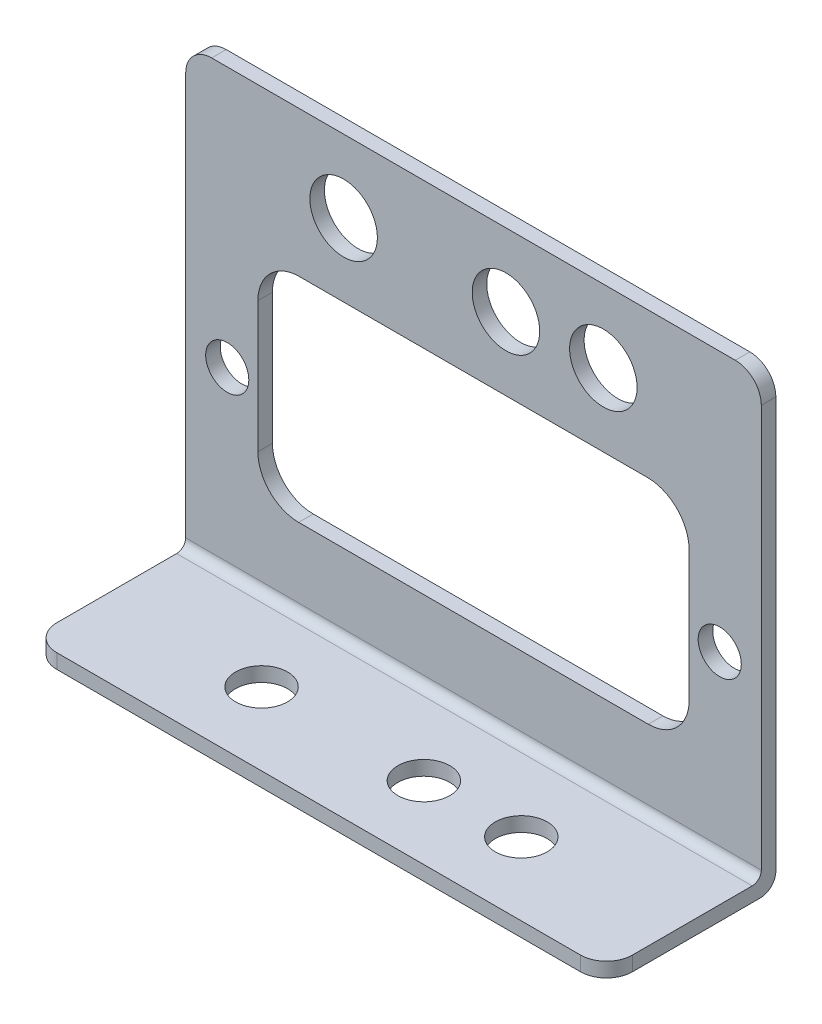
ISO-10303-21;
HEADER;
FILE_DESCRIPTION(('STEP AP214'),'2;1');
FILE_NAME('part.step','',(''),(''),'','','');
FILE_SCHEMA(('AUTOMOTIVE_DESIGN { 1 0 10303 214 1 1 1 1 }'));
ENDSEC;
DATA;
#1=APPLICATION_CONTEXT('core data for automotive mechanical design processes');
#2=APPLICATION_PROTOCOL_DEFINITION('international standard','automotive_design',2000,#1);
#3=PRODUCT_CONTEXT('',#1,'mechanical');
#4=PRODUCT('Part','Part','',(#3));
#5=PRODUCT_RELATED_PRODUCT_CATEGORY('part','',(#4));
#6=PRODUCT_DEFINITION_FORMATION('','',#4);
#7=PRODUCT_DEFINITION_CONTEXT('part definition',#1,'design');
#8=PRODUCT_DEFINITION('design','',#6,#7);
#9=PRODUCT_DEFINITION_SHAPE('','',#8);
#10=(LENGTH_UNIT() NAMED_UNIT(*) SI_UNIT(.MILLI.,.METRE.));
#11=(NAMED_UNIT(*) PLANE_ANGLE_UNIT() SI_UNIT($,.RADIAN.));
#12=(NAMED_UNIT(*) SI_UNIT($,.STERADIAN.) SOLID_ANGLE_UNIT());
#13=UNCERTAINTY_MEASURE_WITH_UNIT(LENGTH_MEASURE(1.E-05),#10,'distance_accuracy_value','');
#14=(GEOMETRIC_REPRESENTATION_CONTEXT(3) GLOBAL_UNCERTAINTY_ASSIGNED_CONTEXT((#13)) GLOBAL_UNIT_ASSIGNED_CONTEXT((#10,
#11,#12)) REPRESENTATION_CONTEXT('',''));
#15=CARTESIAN_POINT('',(0.,0.,0.));
#16=DIRECTION('',(0.,0.,1.));
#17=DIRECTION('',(1.,0.,0.));
#18=AXIS2_PLACEMENT_3D('',#15,#16,#17);
#19=CARTESIAN_POINT('',(56.2864,0.,16.5608));
#20=DIRECTION('',(0.,0.,-1.));
#21=DIRECTION('',(-1.,0.,0.));
#22=AXIS2_PLACEMENT_3D('',#19,#20,#21);
#23=PLANE('',#22);
#24=DIRECTION('',(-1.,0.,0.));
#25=VECTOR('',#24,1.);
#26=CARTESIAN_POINT('',(56.2864,0.,16.5608));
#27=LINE('',#26,#25);
#28=CARTESIAN_POINT('',(53.7464,0.,16.5608));
#29=VERTEX_POINT('',#28);
#30=CARTESIAN_POINT('',(2.54,0.,16.5608));
#31=VERTEX_POINT('',#30);
#32=EDGE_CURVE('E313',#29,#31,#27,.T.);
#33=ORIENTED_EDGE('',*,*,#32,.F.);
#34=DIRECTION('',(0.,-1.,0.));
#35=VECTOR('',#34,1.);
#36=CARTESIAN_POINT('',(53.7464,1.4224,16.5608));
#37=LINE('',#36,#35);
#38=CARTESIAN_POINT('',(53.7464,1.4224,16.5608));
#39=VERTEX_POINT('',#38);
#40=EDGE_CURVE('E326',#29,#39,#37,.F.);
#41=ORIENTED_EDGE('',*,*,#40,.T.);
#42=DIRECTION('',(-1.,0.,0.));
#43=VECTOR('',#42,1.);
#44=CARTESIAN_POINT('',(56.2864,1.4224,16.5608));
#45=LINE('',#44,#43);
#46=CARTESIAN_POINT('',(2.54,1.4224,16.5608));
#47=VERTEX_POINT('',#46);
#48=EDGE_CURVE('E282',#39,#47,#45,.T.);
#49=ORIENTED_EDGE('',*,*,#48,.T.);
#50=DIRECTION('',(0.,-1.,0.));
#51=VECTOR('',#50,1.);
#52=CARTESIAN_POINT('',(2.54,0.,16.5608));
#53=LINE('',#52,#51);
#54=EDGE_CURVE('E323',#47,#31,#53,.T.);
#55=ORIENTED_EDGE('',*,*,#54,.T.);
#56=EDGE_LOOP('',(#33,#41,#49,#55));
#57=FACE_BOUND('',#56,.T.);
#58=ADVANCED_FACE('F32',(#57),#23,.F.);
#59=CARTESIAN_POINT('',(56.2864,0.,1.52400000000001));
#60=DIRECTION('',(0.,1.,0.));
#61=DIRECTION('',(0.,0.,1.));
#62=AXIS2_PLACEMENT_3D('',#59,#60,#61);
#63=PLANE('',#62);
#64=CARTESIAN_POINT('',(31.3182,0.,9.4488));
#65=DIRECTION('',(0.,1.,0.));
#66=DIRECTION('',(0.,0.,1.));
#67=AXIS2_PLACEMENT_3D('',#64,#65,#66);
#68=CIRCLE('',#67,2.54);
#69=CARTESIAN_POINT('',(31.3182,0.,11.9888));
#70=VERTEX_POINT('',#69);
#71=EDGE_CURVE('E249',#70,#70,#68,.T.);
#72=ORIENTED_EDGE('',*,*,#71,.T.);
#73=EDGE_LOOP('',(#72));
#74=FACE_BOUND('',#73,.T.);
#75=CARTESIAN_POINT('',(40.8432,0.,9.4488));
#76=DIRECTION('',(0.,1.,0.));
#77=DIRECTION('',(0.,0.,1.));
#78=AXIS2_PLACEMENT_3D('',#75,#76,#77);
#79=CIRCLE('',#78,2.54);
#80=CARTESIAN_POINT('',(40.8432,0.,11.9888));
#81=VERTEX_POINT('',#80);
#82=EDGE_CURVE('E255',#81,#81,#79,.T.);
#83=ORIENTED_EDGE('',*,*,#82,.T.);
#84=EDGE_LOOP('',(#83));
#85=FACE_BOUND('',#84,.T.);
#86=CARTESIAN_POINT('',(15.4432,0.,9.44880000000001));
#87=DIRECTION('',(0.,1.,0.));
#88=DIRECTION('',(0.,0.,1.));
#89=AXIS2_PLACEMENT_3D('',#86,#87,#88);
#90=CIRCLE('',#89,2.54);
#91=CARTESIAN_POINT('',(15.4432,0.,11.9888));
#92=VERTEX_POINT('',#91);
#93=EDGE_CURVE('E261',#92,#92,#90,.T.);
#94=ORIENTED_EDGE('',*,*,#93,.T.);
#95=EDGE_LOOP('',(#94));
#96=FACE_BOUND('',#95,.T.);
#97=DIRECTION('',(0.,0.,-1.));
#98=VECTOR('',#97,1.);
#99=CARTESIAN_POINT('',(56.2864,0.,1.52400000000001));
#100=LINE('',#99,#98);
#101=CARTESIAN_POINT('',(56.2864,0.,14.0208));
#102=VERTEX_POINT('',#101);
#103=CARTESIAN_POINT('',(56.2864,0.,1.52400000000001));
#104=VERTEX_POINT('',#103);
#105=EDGE_CURVE('E267',#102,#104,#100,.T.);
#106=ORIENTED_EDGE('',*,*,#105,.F.);
#107=CARTESIAN_POINT('',(53.7464,0.,14.0208));
#108=DIRECTION('',(0.,1.,0.));
#109=DIRECTION('',(0.,0.,1.));
#110=AXIS2_PLACEMENT_3D('',#107,#108,#109);
#111=CIRCLE('',#110,2.54);
#112=EDGE_CURVE('E321',#102,#29,#111,.F.);
#113=ORIENTED_EDGE('',*,*,#112,.T.);
#114=ORIENTED_EDGE('',*,*,#32,.T.);
#115=CARTESIAN_POINT('',(2.54,0.,14.0208));
#116=DIRECTION('',(0.,1.,0.));
#117=DIRECTION('',(0.,0.,1.));
#118=AXIS2_PLACEMENT_3D('',#115,#116,#117);
#119=CIRCLE('',#118,2.54);
#120=CARTESIAN_POINT('',(0.,0.,14.0208));
#121=VERTEX_POINT('',#120);
#122=EDGE_CURVE('E319',#31,#121,#119,.F.);
#123=ORIENTED_EDGE('',*,*,#122,.T.);
#124=DIRECTION('',(0.,0.,-1.));
#125=VECTOR('',#124,1.);
#126=CARTESIAN_POINT('',(0.,0.,1.52400000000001));
#127=LINE('',#126,#125);
#128=CARTESIAN_POINT('',(0.,0.,1.52400000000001));
#129=VERTEX_POINT('',#128);
#130=EDGE_CURVE('E264',#121,#129,#127,.T.);
#131=ORIENTED_EDGE('',*,*,#130,.T.);
#132=DIRECTION('',(-1.,0.,0.));
#133=VECTOR('',#132,1.);
#134=CARTESIAN_POINT('',(56.2864,0.,1.52400000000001));
#135=LINE('',#134,#133);
#136=EDGE_CURVE('E310',#104,#129,#135,.T.);
#137=ORIENTED_EDGE('',*,*,#136,.F.);
#138=EDGE_LOOP('',(#106,#113,#114,#123,#131,#137));
#139=FACE_BOUND('',#138,.T.);
#140=ADVANCED_FACE('F385',(#74,#85,#96,#139),#63,.F.);
#141=CARTESIAN_POINT('',(56.2864,1.524,1.524));
#142=DIRECTION('',(-1.,0.,0.));
#143=DIRECTION('',(0.,0.,1.));
#144=AXIS2_PLACEMENT_3D('',#141,#142,#143);
#145=CYLINDRICAL_SURFACE('',#144,1.524);
#146=CARTESIAN_POINT('',(0.,1.524,1.524));
#147=DIRECTION('',(1.,0.,0.));
#148=DIRECTION('',(0.,0.,1.));
#149=AXIS2_PLACEMENT_3D('',#146,#147,#148);
#150=CIRCLE('',#149,1.524);
#151=CARTESIAN_POINT('',(0.,1.52400000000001,0.));
#152=VERTEX_POINT('',#151);
#153=EDGE_CURVE('E284',#129,#152,#150,.T.);
#154=ORIENTED_EDGE('',*,*,#153,.T.);
#155=DIRECTION('',(-1.,0.,0.));
#156=VECTOR('',#155,1.);
#157=CARTESIAN_POINT('',(56.2864,1.52400000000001,0.));
#158=LINE('',#157,#156);
#159=CARTESIAN_POINT('',(56.2864,1.52400000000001,0.));
#160=VERTEX_POINT('',#159);
#161=EDGE_CURVE('E307',#160,#152,#158,.T.);
#162=ORIENTED_EDGE('',*,*,#161,.F.);
#163=CARTESIAN_POINT('',(56.2864,1.524,1.524));
#164=DIRECTION('',(1.,0.,0.));
#165=DIRECTION('',(0.,0.,1.));
#166=AXIS2_PLACEMENT_3D('',#163,#164,#165);
#167=CIRCLE('',#166,1.524);
#168=EDGE_CURVE('E269',#104,#160,#167,.T.);
#169=ORIENTED_EDGE('',*,*,#168,.F.);
#170=ORIENTED_EDGE('',*,*,#136,.T.);
#171=EDGE_LOOP('',(#154,#162,#169,#170));
#172=FACE_BOUND('',#171,.T.);
#173=ADVANCED_FACE('F395',(#172),#145,.T.);
#174=CARTESIAN_POINT('',(56.2864,1.52400000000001,0.));
#175=DIRECTION('',(0.,0.,1.));
#176=DIRECTION('',(1.,0.,0.));
#177=AXIS2_PLACEMENT_3D('',#174,#175,#176);
#178=PLANE('',#177);
#179=CARTESIAN_POINT('',(40.8432,37.1094,0.));
#180=DIRECTION('',(0.,0.,1.));
#181=DIRECTION('',(1.,0.,0.));
#182=AXIS2_PLACEMENT_3D('',#179,#180,#181);
#183=CIRCLE('',#182,3.302);
#184=CARTESIAN_POINT('',(44.1452,37.1094,0.));
#185=VERTEX_POINT('',#184);
#186=EDGE_CURVE('E712',#185,#185,#183,.T.);
#187=ORIENTED_EDGE('',*,*,#186,.T.);
#188=EDGE_LOOP('',(#187));
#189=FACE_BOUND('',#188,.T.);
#190=CARTESIAN_POINT('',(15.4432,37.1094,0.));
#191=DIRECTION('',(0.,0.,1.));
#192=DIRECTION('',(1.,0.,0.));
#193=AXIS2_PLACEMENT_3D('',#190,#191,#192);
#194=CIRCLE('',#193,3.302);
#195=CARTESIAN_POINT('',(18.7452,37.1094,0.));
#196=VERTEX_POINT('',#195);
#197=EDGE_CURVE('E715',#196,#196,#194,.T.);
#198=ORIENTED_EDGE('',*,*,#197,.T.);
#199=EDGE_LOOP('',(#198));
#200=FACE_BOUND('',#199,.T.);
#201=CARTESIAN_POINT('',(31.3182,37.1094,0.));
#202=DIRECTION('',(0.,0.,1.));
#203=DIRECTION('',(1.,0.,0.));
#204=AXIS2_PLACEMENT_3D('',#201,#202,#203);
#205=CIRCLE('',#204,3.302);
#206=CARTESIAN_POINT('',(34.6202,37.1094,0.));
#207=VERTEX_POINT('',#206);
#208=EDGE_CURVE('E706',#207,#207,#205,.T.);
#209=ORIENTED_EDGE('',*,*,#208,.T.);
#210=EDGE_LOOP('',(#209));
#211=FACE_BOUND('',#210,.T.);
#212=CARTESIAN_POINT('',(52.2224,18.7706,0.));
#213=DIRECTION('',(0.,0.,1.));
#214=DIRECTION('',(1.,0.,0.));
#215=AXIS2_PLACEMENT_3D('',#212,#213,#214);
#216=CIRCLE('',#215,2.1082);
#217=CARTESIAN_POINT('',(54.3306,18.7706,0.));
#218=VERTEX_POINT('',#217);
#219=EDGE_CURVE('E700',#218,#218,#216,.T.);
#220=ORIENTED_EDGE('',*,*,#219,.T.);
#221=EDGE_LOOP('',(#220));
#222=FACE_BOUND('',#221,.T.);
#223=CARTESIAN_POINT('',(4.064,18.7706,0.));
#224=DIRECTION('',(0.,0.,1.));
#225=DIRECTION('',(1.,0.,0.));
#226=AXIS2_PLACEMENT_3D('',#223,#224,#225);
#227=CIRCLE('',#226,2.1082);
#228=CARTESIAN_POINT('',(6.1722,18.7706,0.));
#229=VERTEX_POINT('',#228);
#230=EDGE_CURVE('E219',#229,#229,#227,.T.);
#231=ORIENTED_EDGE('',*,*,#230,.T.);
#232=EDGE_LOOP('',(#231));
#233=FACE_BOUND('',#232,.T.);
#234=DIRECTION('',(1.,0.,0.));
#235=VECTOR('',#234,1.);
#236=CARTESIAN_POINT('',(28.1432,9.144,0.));
#237=LINE('',#236,#235);
#238=CARTESIAN_POINT('',(11.049,9.144,0.));
#239=VERTEX_POINT('',#238);
#240=CARTESIAN_POINT('',(45.2374,9.144,0.));
#241=VERTEX_POINT('',#240);
#242=EDGE_CURVE('E182',#239,#241,#237,.T.);
#243=ORIENTED_EDGE('',*,*,#242,.T.);
#244=CARTESIAN_POINT('',(45.2374,13.1318,0.));
#245=DIRECTION('',(0.,0.,1.));
#246=DIRECTION('',(-1.,0.,0.));
#247=AXIS2_PLACEMENT_3D('',#244,#245,#246);
#248=CIRCLE('',#247,3.9878);
#249=CARTESIAN_POINT('',(49.2252,13.1318,0.));
#250=VERTEX_POINT('',#249);
#251=EDGE_CURVE('E174',#241,#250,#248,.T.);
#252=ORIENTED_EDGE('',*,*,#251,.T.);
#253=DIRECTION('',(0.,1.,0.));
#254=VECTOR('',#253,1.);
#255=CARTESIAN_POINT('',(49.2252,25.9334,0.));
#256=LINE('',#255,#254);
#257=CARTESIAN_POINT('',(49.2252,25.9334,0.));
#258=VERTEX_POINT('',#257);
#259=EDGE_CURVE('E186',#250,#258,#256,.T.);
#260=ORIENTED_EDGE('',*,*,#259,.T.);
#261=CARTESIAN_POINT('',(45.1612,25.9334,0.));
#262=DIRECTION('',(0.,0.,1.));
#263=DIRECTION('',(-1.,0.,0.));
#264=AXIS2_PLACEMENT_3D('',#261,#262,#263);
#265=CIRCLE('',#264,4.064);
#266=CARTESIAN_POINT('',(45.1612,29.9974,0.));
#267=VERTEX_POINT('',#266);
#268=EDGE_CURVE('E190',#258,#267,#265,.T.);
#269=ORIENTED_EDGE('',*,*,#268,.T.);
#270=DIRECTION('',(-1.,0.,0.));
#271=VECTOR('',#270,1.);
#272=CARTESIAN_POINT('',(11.1252,29.9974,0.));
#273=LINE('',#272,#271);
#274=CARTESIAN_POINT('',(11.1252,29.9974,0.));
#275=VERTEX_POINT('',#274);
#276=EDGE_CURVE('E205',#267,#275,#273,.T.);
#277=ORIENTED_EDGE('',*,*,#276,.T.);
#278=CARTESIAN_POINT('',(11.1252,25.9334,0.));
#279=DIRECTION('',(0.,0.,1.));
#280=DIRECTION('',(1.,0.,0.));
#281=AXIS2_PLACEMENT_3D('',#278,#279,#280);
#282=CIRCLE('',#281,4.064);
#283=CARTESIAN_POINT('',(7.0612,25.9334,0.));
#284=VERTEX_POINT('',#283);
#285=EDGE_CURVE('E208',#275,#284,#282,.T.);
#286=ORIENTED_EDGE('',*,*,#285,.T.);
#287=DIRECTION('',(0.,-1.,0.));
#288=VECTOR('',#287,1.);
#289=CARTESIAN_POINT('',(7.0612,13.1318,0.));
#290=LINE('',#289,#288);
#291=CARTESIAN_POINT('',(7.0612,13.1318,0.));
#292=VERTEX_POINT('',#291);
#293=EDGE_CURVE('E211',#284,#292,#290,.T.);
#294=ORIENTED_EDGE('',*,*,#293,.T.);
#295=CARTESIAN_POINT('',(11.049,13.1318,0.));
#296=DIRECTION('',(0.,0.,1.));
#297=DIRECTION('',(-1.,0.,0.));
#298=AXIS2_PLACEMENT_3D('',#295,#296,#297);
#299=CIRCLE('',#298,3.9878);
#300=EDGE_CURVE('E214',#292,#239,#299,.T.);
#301=ORIENTED_EDGE('',*,*,#300,.T.);
#302=EDGE_LOOP('',(#243,#252,#260,#269,#277,#286,#294,#301));
#303=FACE_BOUND('',#302,.T.);
#304=DIRECTION('',(-1.,0.,0.));
#305=VECTOR('',#304,1.);
#306=CARTESIAN_POINT('',(56.2864,44.2214,0.));
#307=LINE('',#306,#305);
#308=CARTESIAN_POINT('',(53.7464,44.2214,0.));
#309=VERTEX_POINT('',#308);
#310=CARTESIAN_POINT('',(2.54,44.2214,0.));
#311=VERTEX_POINT('',#310);
#312=EDGE_CURVE('E305',#309,#311,#307,.T.);
#313=ORIENTED_EDGE('',*,*,#312,.F.);
#314=CARTESIAN_POINT('',(53.7464,41.6814,0.));
#315=DIRECTION('',(0.,0.,1.));
#316=DIRECTION('',(1.,0.,0.));
#317=AXIS2_PLACEMENT_3D('',#314,#315,#316);
#318=CIRCLE('',#317,2.54);
#319=CARTESIAN_POINT('',(56.2864,41.6814,0.));
#320=VERTEX_POINT('',#319);
#321=EDGE_CURVE('E40',#309,#320,#318,.F.);
#322=ORIENTED_EDGE('',*,*,#321,.T.);
#323=DIRECTION('',(0.,1.,0.));
#324=VECTOR('',#323,1.);
#325=CARTESIAN_POINT('',(56.2864,1.52400000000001,0.));
#326=LINE('',#325,#324);
#327=EDGE_CURVE('E272',#160,#320,#326,.T.);
#328=ORIENTED_EDGE('',*,*,#327,.F.);
#329=ORIENTED_EDGE('',*,*,#161,.T.);
#330=DIRECTION('',(0.,1.,0.));
#331=VECTOR('',#330,1.);
#332=CARTESIAN_POINT('',(0.,1.52400000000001,0.));
#333=LINE('',#332,#331);
#334=CARTESIAN_POINT('',(0.,41.6814,0.));
#335=VERTEX_POINT('',#334);
#336=EDGE_CURVE('E286',#152,#335,#333,.T.);
#337=ORIENTED_EDGE('',*,*,#336,.T.);
#338=CARTESIAN_POINT('',(2.54,41.6814,0.));
#339=DIRECTION('',(0.,0.,1.));
#340=DIRECTION('',(1.,0.,0.));
#341=AXIS2_PLACEMENT_3D('',#338,#339,#340);
#342=CIRCLE('',#341,2.54);
#343=EDGE_CURVE('E52',#335,#311,#342,.F.);
#344=ORIENTED_EDGE('',*,*,#343,.T.);
#345=EDGE_LOOP('',(#313,#322,#328,#329,#337,#344));
#346=FACE_BOUND('',#345,.T.);
#347=ADVANCED_FACE('F192',(#189,#200,#211,#222,#233,#303,#346),#178,.F.);
#348=CARTESIAN_POINT('',(56.2864,44.2214,0.));
#349=DIRECTION('',(0.,-1.,0.));
#350=DIRECTION('',(0.,0.,-1.));
#351=AXIS2_PLACEMENT_3D('',#348,#349,#350);
#352=PLANE('',#351);
#353=DIRECTION('',(-1.,0.,0.));
#354=VECTOR('',#353,1.);
#355=CARTESIAN_POINT('',(56.2864,44.2214,1.42240000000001));
#356=LINE('',#355,#354);
#357=CARTESIAN_POINT('',(53.7464,44.2214,1.42240000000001));
#358=VERTEX_POINT('',#357);
#359=CARTESIAN_POINT('',(2.54,44.2214,1.42240000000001));
#360=VERTEX_POINT('',#359);
#361=EDGE_CURVE('E302',#358,#360,#356,.T.);
#362=ORIENTED_EDGE('',*,*,#361,.F.);
#363=DIRECTION('',(0.,0.,1.));
#364=VECTOR('',#363,1.);
#365=CARTESIAN_POINT('',(53.7464,44.2214,0.));
#366=LINE('',#365,#364);
#367=EDGE_CURVE('E344',#358,#309,#366,.F.);
#368=ORIENTED_EDGE('',*,*,#367,.T.);
#369=ORIENTED_EDGE('',*,*,#312,.T.);
#370=DIRECTION('',(0.,0.,1.));
#371=VECTOR('',#370,1.);
#372=CARTESIAN_POINT('',(2.54,44.2214,0.));
#373=LINE('',#372,#371);
#374=EDGE_CURVE('E341',#311,#360,#373,.T.);
#375=ORIENTED_EDGE('',*,*,#374,.T.);
#376=EDGE_LOOP('',(#362,#368,#369,#375));
#377=FACE_BOUND('',#376,.T.);
#378=ADVANCED_FACE('F362',(#377),#352,.F.);
#379=CARTESIAN_POINT('',(56.2864,44.2214,1.42240000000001));
#380=DIRECTION('',(0.,0.,-1.));
#381=DIRECTION('',(0.,1.,0.));
#382=AXIS2_PLACEMENT_3D('',#379,#380,#381);
#383=PLANE('',#382);
#384=CARTESIAN_POINT('',(40.8432,37.1094,1.4224));
#385=DIRECTION('',(0.,0.,1.));
#386=DIRECTION('',(1.,0.,0.));
#387=AXIS2_PLACEMENT_3D('',#384,#385,#386);
#388=CIRCLE('',#387,3.302);
#389=CARTESIAN_POINT('',(44.1452,37.1094,1.4224));
#390=VERTEX_POINT('',#389);
#391=EDGE_CURVE('E673',#390,#390,#388,.T.);
#392=ORIENTED_EDGE('',*,*,#391,.F.);
#393=EDGE_LOOP('',(#392));
#394=FACE_BOUND('',#393,.T.);
#395=CARTESIAN_POINT('',(15.4432,37.1094,1.4224));
#396=DIRECTION('',(0.,0.,1.));
#397=DIRECTION('',(1.,0.,0.));
#398=AXIS2_PLACEMENT_3D('',#395,#396,#397);
#399=CIRCLE('',#398,3.302);
#400=CARTESIAN_POINT('',(18.7452,37.1094,1.4224));
#401=VERTEX_POINT('',#400);
#402=EDGE_CURVE('E677',#401,#401,#399,.T.);
#403=ORIENTED_EDGE('',*,*,#402,.F.);
#404=EDGE_LOOP('',(#403));
#405=FACE_BOUND('',#404,.T.);
#406=CARTESIAN_POINT('',(31.3182,37.1094,1.4224));
#407=DIRECTION('',(0.,0.,1.));
#408=DIRECTION('',(1.,0.,0.));
#409=AXIS2_PLACEMENT_3D('',#406,#407,#408);
#410=CIRCLE('',#409,3.302);
#411=CARTESIAN_POINT('',(34.6202,37.1094,1.4224));
#412=VERTEX_POINT('',#411);
#413=EDGE_CURVE('E681',#412,#412,#410,.T.);
#414=ORIENTED_EDGE('',*,*,#413,.F.);
#415=EDGE_LOOP('',(#414));
#416=FACE_BOUND('',#415,.T.);
#417=CARTESIAN_POINT('',(52.2224,18.7706,1.4224));
#418=DIRECTION('',(0.,0.,1.));
#419=DIRECTION('',(1.,0.,0.));
#420=AXIS2_PLACEMENT_3D('',#417,#418,#419);
#421=CIRCLE('',#420,2.1082);
#422=CARTESIAN_POINT('',(54.3306,18.7706,1.4224));
#423=VERTEX_POINT('',#422);
#424=EDGE_CURVE('E685',#423,#423,#421,.T.);
#425=ORIENTED_EDGE('',*,*,#424,.F.);
#426=EDGE_LOOP('',(#425));
#427=FACE_BOUND('',#426,.T.);
#428=CARTESIAN_POINT('',(4.064,18.7706,1.4224));
#429=DIRECTION('',(0.,0.,1.));
#430=DIRECTION('',(1.,0.,0.));
#431=AXIS2_PLACEMENT_3D('',#428,#429,#430);
#432=CIRCLE('',#431,2.1082);
#433=CARTESIAN_POINT('',(6.1722,18.7706,1.4224));
#434=VERTEX_POINT('',#433);
#435=EDGE_CURVE('E201',#434,#434,#432,.T.);
#436=ORIENTED_EDGE('',*,*,#435,.F.);
#437=EDGE_LOOP('',(#436));
#438=FACE_BOUND('',#437,.T.);
#439=DIRECTION('',(0.,1.,0.));
#440=VECTOR('',#439,1.);
#441=CARTESIAN_POINT('',(49.2252,25.9334,1.4224));
#442=LINE('',#441,#440);
#443=CARTESIAN_POINT('',(49.2252,13.1318,1.4224));
#444=VERTEX_POINT('',#443);
#445=CARTESIAN_POINT('',(49.2252,25.9334,1.4224));
#446=VERTEX_POINT('',#445);
#447=EDGE_CURVE('E218',#444,#446,#442,.T.);
#448=ORIENTED_EDGE('',*,*,#447,.F.);
#449=CARTESIAN_POINT('',(45.2374,13.1318,1.4224));
#450=DIRECTION('',(0.,0.,1.));
#451=DIRECTION('',(-1.,0.,0.));
#452=AXIS2_PLACEMENT_3D('',#449,#450,#451);
#453=CIRCLE('',#452,3.9878);
#454=CARTESIAN_POINT('',(45.2374,9.144,1.4224));
#455=VERTEX_POINT('',#454);
#456=EDGE_CURVE('E177',#455,#444,#453,.T.);
#457=ORIENTED_EDGE('',*,*,#456,.F.);
#458=DIRECTION('',(1.,0.,0.));
#459=VECTOR('',#458,1.);
#460=CARTESIAN_POINT('',(45.2374,9.144,1.4224));
#461=LINE('',#460,#459);
#462=CARTESIAN_POINT('',(11.049,9.144,1.4224));
#463=VERTEX_POINT('',#462);
#464=EDGE_CURVE('E195',#463,#455,#461,.T.);
#465=ORIENTED_EDGE('',*,*,#464,.F.);
#466=CARTESIAN_POINT('',(11.049,13.1318,1.4224));
#467=DIRECTION('',(0.,0.,1.));
#468=DIRECTION('',(-1.,0.,0.));
#469=AXIS2_PLACEMENT_3D('',#466,#467,#468);
#470=CIRCLE('',#469,3.9878);
#471=CARTESIAN_POINT('',(7.0612,13.1318,1.4224));
#472=VERTEX_POINT('',#471);
#473=EDGE_CURVE('E198',#472,#463,#470,.T.);
#474=ORIENTED_EDGE('',*,*,#473,.F.);
#475=DIRECTION('',(0.,-1.,0.));
#476=VECTOR('',#475,1.);
#477=CARTESIAN_POINT('',(7.0612,13.1318,1.4224));
#478=LINE('',#477,#476);
#479=CARTESIAN_POINT('',(7.0612,25.9334,1.4224));
#480=VERTEX_POINT('',#479);
#481=EDGE_CURVE('E230',#480,#472,#478,.T.);
#482=ORIENTED_EDGE('',*,*,#481,.F.);
#483=CARTESIAN_POINT('',(11.1252,25.9334,1.4224));
#484=DIRECTION('',(0.,0.,1.));
#485=DIRECTION('',(1.,0.,0.));
#486=AXIS2_PLACEMENT_3D('',#483,#484,#485);
#487=CIRCLE('',#486,4.064);
#488=CARTESIAN_POINT('',(11.1252,29.9974,1.4224));
#489=VERTEX_POINT('',#488);
#490=EDGE_CURVE('E227',#489,#480,#487,.T.);
#491=ORIENTED_EDGE('',*,*,#490,.F.);
#492=DIRECTION('',(-1.,0.,0.));
#493=VECTOR('',#492,1.);
#494=CARTESIAN_POINT('',(11.1252,29.9974,1.4224));
#495=LINE('',#494,#493);
#496=CARTESIAN_POINT('',(45.1612,29.9974,1.4224));
#497=VERTEX_POINT('',#496);
#498=EDGE_CURVE('E224',#497,#489,#495,.T.);
#499=ORIENTED_EDGE('',*,*,#498,.F.);
#500=CARTESIAN_POINT('',(45.1612,25.9334,1.4224));
#501=DIRECTION('',(0.,0.,1.));
#502=DIRECTION('',(-1.,0.,0.));
#503=AXIS2_PLACEMENT_3D('',#500,#501,#502);
#504=CIRCLE('',#503,4.064);
#505=EDGE_CURVE('E221',#446,#497,#504,.T.);
#506=ORIENTED_EDGE('',*,*,#505,.F.);
#507=EDGE_LOOP('',(#448,#457,#465,#474,#482,#491,#499,#506));
#508=FACE_BOUND('',#507,.T.);
#509=DIRECTION('',(0.,-1.,0.));
#510=VECTOR('',#509,1.);
#511=CARTESIAN_POINT('',(56.2864,44.2214,1.42240000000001));
#512=LINE('',#511,#510);
#513=CARTESIAN_POINT('',(56.2864,41.6814,1.4224));
#514=VERTEX_POINT('',#513);
#515=CARTESIAN_POINT('',(56.2864,2.31140000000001,1.4224));
#516=VERTEX_POINT('',#515);
#517=EDGE_CURVE('E275',#514,#516,#512,.T.);
#518=ORIENTED_EDGE('',*,*,#517,.F.);
#519=CARTESIAN_POINT('',(53.7464,41.6814,1.4224));
#520=DIRECTION('',(0.,0.,-1.));
#521=DIRECTION('',(0.,1.,0.));
#522=AXIS2_PLACEMENT_3D('',#519,#520,#521);
#523=CIRCLE('',#522,2.54);
#524=EDGE_CURVE('E339',#514,#358,#523,.F.);
#525=ORIENTED_EDGE('',*,*,#524,.T.);
#526=ORIENTED_EDGE('',*,*,#361,.T.);
#527=CARTESIAN_POINT('',(2.54,41.6814,1.4224));
#528=DIRECTION('',(0.,0.,-1.));
#529=DIRECTION('',(0.,1.,0.));
#530=AXIS2_PLACEMENT_3D('',#527,#528,#529);
#531=CIRCLE('',#530,2.54);
#532=CARTESIAN_POINT('',(0.,41.6814,1.4224));
#533=VERTEX_POINT('',#532);
#534=EDGE_CURVE('E337',#360,#533,#531,.F.);
#535=ORIENTED_EDGE('',*,*,#534,.T.);
#536=DIRECTION('',(0.,-1.,0.));
#537=VECTOR('',#536,1.);
#538=CARTESIAN_POINT('',(0.,44.2214,1.42240000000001));
#539=LINE('',#538,#537);
#540=CARTESIAN_POINT('',(0.,2.31140000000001,1.4224));
#541=VERTEX_POINT('',#540);
#542=EDGE_CURVE('E288',#533,#541,#539,.T.);
#543=ORIENTED_EDGE('',*,*,#542,.T.);
#544=DIRECTION('',(-1.,0.,0.));
#545=VECTOR('',#544,1.);
#546=CARTESIAN_POINT('',(56.2864,2.31140000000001,1.4224));
#547=LINE('',#546,#545);
#548=EDGE_CURVE('E299',#516,#541,#547,.T.);
#549=ORIENTED_EDGE('',*,*,#548,.F.);
#550=EDGE_LOOP('',(#518,#525,#526,#535,#543,#549));
#551=FACE_BOUND('',#550,.T.);
#552=ADVANCED_FACE('F359',(#394,#405,#416,#427,#438,#508,#551),#383,.F.);
#553=CARTESIAN_POINT('',(56.2864,2.3114,2.3114));
#554=DIRECTION('',(-1.,0.,0.));
#555=DIRECTION('',(0.,0.,1.));
#556=AXIS2_PLACEMENT_3D('',#553,#554,#555);
#557=CYLINDRICAL_SURFACE('',#556,0.889);
#558=CARTESIAN_POINT('',(0.,2.3114,2.3114));
#559=DIRECTION('',(-1.,0.,0.));
#560=DIRECTION('',(0.,0.,-1.));
#561=AXIS2_PLACEMENT_3D('',#558,#559,#560);
#562=CIRCLE('',#561,0.889);
#563=CARTESIAN_POINT('',(0.,1.4224,2.31140000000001));
#564=VERTEX_POINT('',#563);
#565=EDGE_CURVE('E290',#541,#564,#562,.T.);
#566=ORIENTED_EDGE('',*,*,#565,.T.);
#567=DIRECTION('',(-1.,0.,0.));
#568=VECTOR('',#567,1.);
#569=CARTESIAN_POINT('',(56.2864,1.4224,2.31140000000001));
#570=LINE('',#569,#568);
#571=CARTESIAN_POINT('',(56.2864,1.4224,2.31140000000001));
#572=VERTEX_POINT('',#571);
#573=EDGE_CURVE('E296',#572,#564,#570,.T.);
#574=ORIENTED_EDGE('',*,*,#573,.F.);
#575=CARTESIAN_POINT('',(56.2864,2.3114,2.3114));
#576=DIRECTION('',(-1.,0.,0.));
#577=DIRECTION('',(0.,0.,-1.));
#578=AXIS2_PLACEMENT_3D('',#575,#576,#577);
#579=CIRCLE('',#578,0.889);
#580=EDGE_CURVE('E277',#516,#572,#579,.T.);
#581=ORIENTED_EDGE('',*,*,#580,.F.);
#582=ORIENTED_EDGE('',*,*,#548,.T.);
#583=EDGE_LOOP('',(#566,#574,#581,#582));
#584=FACE_BOUND('',#583,.T.);
#585=ADVANCED_FACE('F370',(#584),#557,.F.);
#586=CARTESIAN_POINT('',(56.2864,1.4224,16.5608));
#587=DIRECTION('',(0.,-1.,0.));
#588=DIRECTION('',(0.,0.,-1.));
#589=AXIS2_PLACEMENT_3D('',#586,#587,#588);
#590=PLANE('',#589);
#591=CARTESIAN_POINT('',(31.3182,1.4224,9.4488));
#592=DIRECTION('',(0.,1.,0.));
#593=DIRECTION('',(0.,0.,1.));
#594=AXIS2_PLACEMENT_3D('',#591,#592,#593);
#595=CIRCLE('',#594,2.54);
#596=CARTESIAN_POINT('',(31.3182,1.4224,11.9888));
#597=VERTEX_POINT('',#596);
#598=EDGE_CURVE('E237',#597,#597,#595,.T.);
#599=ORIENTED_EDGE('',*,*,#598,.F.);
#600=EDGE_LOOP('',(#599));
#601=FACE_BOUND('',#600,.T.);
#602=CARTESIAN_POINT('',(40.8432,1.4224,9.4488));
#603=DIRECTION('',(0.,1.,0.));
#604=DIRECTION('',(0.,0.,1.));
#605=AXIS2_PLACEMENT_3D('',#602,#603,#604);
#606=CIRCLE('',#605,2.54);
#607=CARTESIAN_POINT('',(40.8432,1.4224,11.9888));
#608=VERTEX_POINT('',#607);
#609=EDGE_CURVE('E252',#608,#608,#606,.T.);
#610=ORIENTED_EDGE('',*,*,#609,.F.);
#611=EDGE_LOOP('',(#610));
#612=FACE_BOUND('',#611,.T.);
#613=CARTESIAN_POINT('',(15.4432,1.4224,9.44880000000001));
#614=DIRECTION('',(0.,1.,0.));
#615=DIRECTION('',(0.,0.,1.));
#616=AXIS2_PLACEMENT_3D('',#613,#614,#615);
#617=CIRCLE('',#616,2.54);
#618=CARTESIAN_POINT('',(15.4432,1.4224,11.9888));
#619=VERTEX_POINT('',#618);
#620=EDGE_CURVE('E258',#619,#619,#617,.T.);
#621=ORIENTED_EDGE('',*,*,#620,.F.);
#622=EDGE_LOOP('',(#621));
#623=FACE_BOUND('',#622,.T.);
#624=ORIENTED_EDGE('',*,*,#48,.F.);
#625=CARTESIAN_POINT('',(53.7464,1.4224,14.0208));
#626=DIRECTION('',(0.,-1.,0.));
#627=DIRECTION('',(0.,0.,-1.));
#628=AXIS2_PLACEMENT_3D('',#625,#626,#627);
#629=CIRCLE('',#628,2.54);
#630=CARTESIAN_POINT('',(56.2864,1.4224,14.0208));
#631=VERTEX_POINT('',#630);
#632=EDGE_CURVE('E330',#39,#631,#629,.F.);
#633=ORIENTED_EDGE('',*,*,#632,.T.);
#634=DIRECTION('',(0.,0.,1.));
#635=VECTOR('',#634,1.);
#636=CARTESIAN_POINT('',(56.2864,1.4224,16.5608));
#637=LINE('',#636,#635);
#638=EDGE_CURVE('E279',#572,#631,#637,.T.);
#639=ORIENTED_EDGE('',*,*,#638,.F.);
#640=ORIENTED_EDGE('',*,*,#573,.T.);
#641=DIRECTION('',(0.,0.,1.));
#642=VECTOR('',#641,1.);
#643=CARTESIAN_POINT('',(0.,1.4224,16.5608));
#644=LINE('',#643,#642);
#645=CARTESIAN_POINT('',(0.,1.4224,14.0208));
#646=VERTEX_POINT('',#645);
#647=EDGE_CURVE('E270',#564,#646,#644,.T.);
#648=ORIENTED_EDGE('',*,*,#647,.T.);
#649=CARTESIAN_POINT('',(2.54,1.4224,14.0208));
#650=DIRECTION('',(0.,-1.,0.));
#651=DIRECTION('',(0.,0.,-1.));
#652=AXIS2_PLACEMENT_3D('',#649,#650,#651);
#653=CIRCLE('',#652,2.54);
#654=EDGE_CURVE('E328',#646,#47,#653,.F.);
#655=ORIENTED_EDGE('',*,*,#654,.T.);
#656=EDGE_LOOP('',(#624,#633,#639,#640,#648,#655));
#657=FACE_BOUND('',#656,.T.);
#658=ADVANCED_FACE('F375',(#601,#612,#623,#657),#590,.F.);
#659=CARTESIAN_POINT('',(56.2864,2.3114,2.3114));
#660=DIRECTION('',(1.,0.,0.));
#661=DIRECTION('',(0.,0.,-1.));
#662=AXIS2_PLACEMENT_3D('',#659,#660,#661);
#663=PLANE('',#662);
#664=ORIENTED_EDGE('',*,*,#327,.T.);
#665=DIRECTION('',(0.,0.,1.));
#666=VECTOR('',#665,1.);
#667=CARTESIAN_POINT('',(56.2864,41.6814,1.42240000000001));
#668=LINE('',#667,#666);
#669=EDGE_CURVE('E334',#320,#514,#668,.T.);
#670=ORIENTED_EDGE('',*,*,#669,.T.);
#671=ORIENTED_EDGE('',*,*,#517,.T.);
#672=ORIENTED_EDGE('',*,*,#580,.T.);
#673=ORIENTED_EDGE('',*,*,#638,.T.);
#674=DIRECTION('',(0.,-1.,0.));
#675=VECTOR('',#674,1.);
#676=CARTESIAN_POINT('',(56.2864,0.,14.0208));
#677=LINE('',#676,#675);
#678=EDGE_CURVE('E316',#631,#102,#677,.T.);
#679=ORIENTED_EDGE('',*,*,#678,.T.);
#680=ORIENTED_EDGE('',*,*,#105,.T.);
#681=ORIENTED_EDGE('',*,*,#168,.T.);
#682=EDGE_LOOP('',(#664,#670,#671,#672,#673,#679,#680,#681));
#683=FACE_BOUND('',#682,.T.);
#684=ADVANCED_FACE('F352',(#683),#663,.T.);
#685=CARTESIAN_POINT('',(0.,2.3114,2.3114));
#686=DIRECTION('',(1.,0.,0.));
#687=DIRECTION('',(0.,0.,-1.));
#688=AXIS2_PLACEMENT_3D('',#685,#686,#687);
#689=PLANE('',#688);
#690=ORIENTED_EDGE('',*,*,#542,.F.);
#691=DIRECTION('',(0.,0.,1.));
#692=VECTOR('',#691,1.);
#693=CARTESIAN_POINT('',(0.,41.6814,2.3114));
#694=LINE('',#693,#692);
#695=EDGE_CURVE('E11',#533,#335,#694,.F.);
#696=ORIENTED_EDGE('',*,*,#695,.T.);
#697=ORIENTED_EDGE('',*,*,#336,.F.);
#698=ORIENTED_EDGE('',*,*,#153,.F.);
#699=ORIENTED_EDGE('',*,*,#130,.F.);
#700=DIRECTION('',(0.,-1.,0.));
#701=VECTOR('',#700,1.);
#702=CARTESIAN_POINT('',(0.,2.3114,14.0208));
#703=LINE('',#702,#701);
#704=EDGE_CURVE('E332',#121,#646,#703,.F.);
#705=ORIENTED_EDGE('',*,*,#704,.T.);
#706=ORIENTED_EDGE('',*,*,#647,.F.);
#707=ORIENTED_EDGE('',*,*,#565,.F.);
#708=EDGE_LOOP('',(#690,#696,#697,#698,#699,#705,#706,#707));
#709=FACE_BOUND('',#708,.T.);
#710=ADVANCED_FACE('F366',(#709),#689,.F.);
#711=CARTESIAN_POINT('',(15.4432,0.,9.44880000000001));
#712=DIRECTION('',(0.,1.,0.));
#713=DIRECTION('',(0.,0.,1.));
#714=AXIS2_PLACEMENT_3D('',#711,#712,#713);
#715=CYLINDRICAL_SURFACE('',#714,2.54);
#716=ORIENTED_EDGE('',*,*,#93,.F.);
#717=EDGE_LOOP('',(#716));
#718=FACE_BOUND('',#717,.T.);
#719=ORIENTED_EDGE('',*,*,#620,.T.);
#720=EDGE_LOOP('',(#719));
#721=FACE_BOUND('',#720,.T.);
#722=ADVANCED_FACE('F478',(#718,#721),#715,.F.);
#723=CARTESIAN_POINT('',(40.8432,0.,9.4488));
#724=DIRECTION('',(0.,1.,0.));
#725=DIRECTION('',(0.,0.,1.));
#726=AXIS2_PLACEMENT_3D('',#723,#724,#725);
#727=CYLINDRICAL_SURFACE('',#726,2.54);
#728=ORIENTED_EDGE('',*,*,#82,.F.);
#729=EDGE_LOOP('',(#728));
#730=FACE_BOUND('',#729,.T.);
#731=ORIENTED_EDGE('',*,*,#609,.T.);
#732=EDGE_LOOP('',(#731));
#733=FACE_BOUND('',#732,.T.);
#734=ADVANCED_FACE('F474',(#730,#733),#727,.F.);
#735=CARTESIAN_POINT('',(31.3182,0.,9.4488));
#736=DIRECTION('',(0.,1.,0.));
#737=DIRECTION('',(0.,0.,1.));
#738=AXIS2_PLACEMENT_3D('',#735,#736,#737);
#739=CYLINDRICAL_SURFACE('',#738,2.54);
#740=ORIENTED_EDGE('',*,*,#71,.F.);
#741=EDGE_LOOP('',(#740));
#742=FACE_BOUND('',#741,.T.);
#743=ORIENTED_EDGE('',*,*,#598,.T.);
#744=EDGE_LOOP('',(#743));
#745=FACE_BOUND('',#744,.T.);
#746=ADVANCED_FACE('F471',(#742,#745),#739,.F.);
#747=CARTESIAN_POINT('',(45.2374,13.1318,0.));
#748=DIRECTION('',(0.,0.,1.));
#749=DIRECTION('',(1.,0.,0.));
#750=AXIS2_PLACEMENT_3D('',#747,#748,#749);
#751=CYLINDRICAL_SURFACE('',#750,3.9878);
#752=ORIENTED_EDGE('',*,*,#456,.T.);
#753=DIRECTION('',(0.,0.,1.));
#754=VECTOR('',#753,1.);
#755=CARTESIAN_POINT('',(49.2252,13.1318,0.));
#756=LINE('',#755,#754);
#757=EDGE_CURVE('E170',#250,#444,#756,.T.);
#758=ORIENTED_EDGE('',*,*,#757,.F.);
#759=ORIENTED_EDGE('',*,*,#251,.F.);
#760=DIRECTION('',(0.,0.,1.));
#761=VECTOR('',#760,1.);
#762=CARTESIAN_POINT('',(45.2374,9.144,0.));
#763=LINE('',#762,#761);
#764=EDGE_CURVE('E235',#241,#455,#763,.T.);
#765=ORIENTED_EDGE('',*,*,#764,.T.);
#766=EDGE_LOOP('',(#752,#758,#759,#765));
#767=FACE_BOUND('',#766,.T.);
#768=ADVANCED_FACE('F172',(#767),#751,.F.);
#769=CARTESIAN_POINT('',(45.2374,9.144,0.));
#770=DIRECTION('',(0.,-1.,0.));
#771=DIRECTION('',(1.,0.,0.));
#772=AXIS2_PLACEMENT_3D('',#769,#770,#771);
#773=PLANE('',#772);
#774=ORIENTED_EDGE('',*,*,#464,.T.);
#775=ORIENTED_EDGE('',*,*,#764,.F.);
#776=ORIENTED_EDGE('',*,*,#242,.F.);
#777=DIRECTION('',(0.,0.,1.));
#778=VECTOR('',#777,1.);
#779=CARTESIAN_POINT('',(11.049,9.144,0.));
#780=LINE('',#779,#778);
#781=EDGE_CURVE('E238',#239,#463,#780,.T.);
#782=ORIENTED_EDGE('',*,*,#781,.T.);
#783=EDGE_LOOP('',(#774,#775,#776,#782));
#784=FACE_BOUND('',#783,.T.);
#785=ADVANCED_FACE('F443',(#784),#773,.F.);
#786=CARTESIAN_POINT('',(11.049,13.1318,0.));
#787=DIRECTION('',(0.,0.,1.));
#788=DIRECTION('',(1.,0.,0.));
#789=AXIS2_PLACEMENT_3D('',#786,#787,#788);
#790=CYLINDRICAL_SURFACE('',#789,3.9878);
#791=ORIENTED_EDGE('',*,*,#473,.T.);
#792=ORIENTED_EDGE('',*,*,#781,.F.);
#793=ORIENTED_EDGE('',*,*,#300,.F.);
#794=DIRECTION('',(0.,0.,1.));
#795=VECTOR('',#794,1.);
#796=CARTESIAN_POINT('',(7.0612,13.1318,0.));
#797=LINE('',#796,#795);
#798=EDGE_CURVE('E240',#292,#472,#797,.T.);
#799=ORIENTED_EDGE('',*,*,#798,.T.);
#800=EDGE_LOOP('',(#791,#792,#793,#799));
#801=FACE_BOUND('',#800,.T.);
#802=ADVANCED_FACE('F446',(#801),#790,.F.);
#803=CARTESIAN_POINT('',(7.0612,13.1318,0.));
#804=DIRECTION('',(-1.,0.,0.));
#805=DIRECTION('',(0.,0.,1.));
#806=AXIS2_PLACEMENT_3D('',#803,#804,#805);
#807=PLANE('',#806);
#808=ORIENTED_EDGE('',*,*,#481,.T.);
#809=ORIENTED_EDGE('',*,*,#798,.F.);
#810=ORIENTED_EDGE('',*,*,#293,.F.);
#811=DIRECTION('',(0.,0.,1.));
#812=VECTOR('',#811,1.);
#813=CARTESIAN_POINT('',(7.0612,25.9334,0.));
#814=LINE('',#813,#812);
#815=EDGE_CURVE('E242',#284,#480,#814,.T.);
#816=ORIENTED_EDGE('',*,*,#815,.T.);
#817=EDGE_LOOP('',(#808,#809,#810,#816));
#818=FACE_BOUND('',#817,.T.);
#819=ADVANCED_FACE('F450',(#818),#807,.F.);
#820=CARTESIAN_POINT('',(11.1252,25.9334,0.));
#821=DIRECTION('',(0.,0.,1.));
#822=DIRECTION('',(1.,0.,0.));
#823=AXIS2_PLACEMENT_3D('',#820,#821,#822);
#824=CYLINDRICAL_SURFACE('',#823,4.064);
#825=ORIENTED_EDGE('',*,*,#490,.T.);
#826=ORIENTED_EDGE('',*,*,#815,.F.);
#827=ORIENTED_EDGE('',*,*,#285,.F.);
#828=DIRECTION('',(0.,0.,1.));
#829=VECTOR('',#828,1.);
#830=CARTESIAN_POINT('',(11.1252,29.9974,0.));
#831=LINE('',#830,#829);
#832=EDGE_CURVE('E244',#275,#489,#831,.T.);
#833=ORIENTED_EDGE('',*,*,#832,.T.);
#834=EDGE_LOOP('',(#825,#826,#827,#833));
#835=FACE_BOUND('',#834,.T.);
#836=ADVANCED_FACE('F454',(#835),#824,.F.);
#837=CARTESIAN_POINT('',(11.1252,29.9974,0.));
#838=DIRECTION('',(0.,1.,0.));
#839=DIRECTION('',(0.,0.,1.));
#840=AXIS2_PLACEMENT_3D('',#837,#838,#839);
#841=PLANE('',#840);
#842=ORIENTED_EDGE('',*,*,#498,.T.);
#843=ORIENTED_EDGE('',*,*,#832,.F.);
#844=ORIENTED_EDGE('',*,*,#276,.F.);
#845=DIRECTION('',(0.,0.,1.));
#846=VECTOR('',#845,1.);
#847=CARTESIAN_POINT('',(45.1612,29.9974,0.));
#848=LINE('',#847,#846);
#849=EDGE_CURVE('E246',#267,#497,#848,.T.);
#850=ORIENTED_EDGE('',*,*,#849,.T.);
#851=EDGE_LOOP('',(#842,#843,#844,#850));
#852=FACE_BOUND('',#851,.T.);
#853=ADVANCED_FACE('F458',(#852),#841,.F.);
#854=CARTESIAN_POINT('',(45.1612,25.9334,0.));
#855=DIRECTION('',(0.,0.,1.));
#856=DIRECTION('',(1.,0.,0.));
#857=AXIS2_PLACEMENT_3D('',#854,#855,#856);
#858=CYLINDRICAL_SURFACE('',#857,4.064);
#859=ORIENTED_EDGE('',*,*,#505,.T.);
#860=ORIENTED_EDGE('',*,*,#849,.F.);
#861=ORIENTED_EDGE('',*,*,#268,.F.);
#862=DIRECTION('',(0.,0.,1.));
#863=VECTOR('',#862,1.);
#864=CARTESIAN_POINT('',(49.2252,25.9334,0.));
#865=LINE('',#864,#863);
#866=EDGE_CURVE('E181',#258,#446,#865,.T.);
#867=ORIENTED_EDGE('',*,*,#866,.T.);
#868=EDGE_LOOP('',(#859,#860,#861,#867));
#869=FACE_BOUND('',#868,.T.);
#870=ADVANCED_FACE('F462',(#869),#858,.F.);
#871=CARTESIAN_POINT('',(49.2252,25.9334,0.));
#872=DIRECTION('',(1.,0.,0.));
#873=DIRECTION('',(0.,0.,-1.));
#874=AXIS2_PLACEMENT_3D('',#871,#872,#873);
#875=PLANE('',#874);
#876=ORIENTED_EDGE('',*,*,#447,.T.);
#877=ORIENTED_EDGE('',*,*,#866,.F.);
#878=ORIENTED_EDGE('',*,*,#259,.F.);
#879=ORIENTED_EDGE('',*,*,#757,.T.);
#880=EDGE_LOOP('',(#876,#877,#878,#879));
#881=FACE_BOUND('',#880,.T.);
#882=ADVANCED_FACE('F187',(#881),#875,.F.);
#883=CARTESIAN_POINT('',(53.7464,2.3114,14.0208));
#884=DIRECTION('',(0.,1.,0.));
#885=DIRECTION('',(0.,0.,1.));
#886=AXIS2_PLACEMENT_3D('',#883,#884,#885);
#887=CYLINDRICAL_SURFACE('',#886,2.54);
#888=ORIENTED_EDGE('',*,*,#632,.F.);
#889=ORIENTED_EDGE('',*,*,#40,.F.);
#890=ORIENTED_EDGE('',*,*,#112,.F.);
#891=ORIENTED_EDGE('',*,*,#678,.F.);
#892=EDGE_LOOP('',(#888,#889,#890,#891));
#893=FACE_BOUND('',#892,.T.);
#894=ADVANCED_FACE('F381',(#893),#887,.T.);
#895=CARTESIAN_POINT('',(2.54,0.,14.0208));
#896=DIRECTION('',(0.,-1.,0.));
#897=DIRECTION('',(0.,0.,-1.));
#898=AXIS2_PLACEMENT_3D('',#895,#896,#897);
#899=CYLINDRICAL_SURFACE('',#898,2.54);
#900=ORIENTED_EDGE('',*,*,#654,.F.);
#901=ORIENTED_EDGE('',*,*,#704,.F.);
#902=ORIENTED_EDGE('',*,*,#122,.F.);
#903=ORIENTED_EDGE('',*,*,#54,.F.);
#904=EDGE_LOOP('',(#900,#901,#902,#903));
#905=FACE_BOUND('',#904,.T.);
#906=ADVANCED_FACE('F390',(#905),#899,.T.);
#907=CARTESIAN_POINT('',(4.064,18.7706,0.));
#908=DIRECTION('',(0.,0.,1.));
#909=DIRECTION('',(1.,0.,0.));
#910=AXIS2_PLACEMENT_3D('',#907,#908,#909);
#911=CYLINDRICAL_SURFACE('',#910,2.1082);
#912=ORIENTED_EDGE('',*,*,#230,.F.);
#913=EDGE_LOOP('',(#912));
#914=FACE_BOUND('',#913,.T.);
#915=ORIENTED_EDGE('',*,*,#435,.T.);
#916=EDGE_LOOP('',(#915));
#917=FACE_BOUND('',#916,.T.);
#918=ADVANCED_FACE('F414',(#914,#917),#911,.F.);
#919=CARTESIAN_POINT('',(52.2224,18.7706,0.));
#920=DIRECTION('',(0.,0.,1.));
#921=DIRECTION('',(1.,0.,0.));
#922=AXIS2_PLACEMENT_3D('',#919,#920,#921);
#923=CYLINDRICAL_SURFACE('',#922,2.1082);
#924=ORIENTED_EDGE('',*,*,#219,.F.);
#925=EDGE_LOOP('',(#924));
#926=FACE_BOUND('',#925,.T.);
#927=ORIENTED_EDGE('',*,*,#424,.T.);
#928=EDGE_LOOP('',(#927));
#929=FACE_BOUND('',#928,.T.);
#930=ADVANCED_FACE('F435',(#926,#929),#923,.F.);
#931=CARTESIAN_POINT('',(31.3182,37.1094,-1.1176));
#932=DIRECTION('',(0.,0.,1.));
#933=DIRECTION('',(1.,0.,0.));
#934=AXIS2_PLACEMENT_3D('',#931,#932,#933);
#935=CYLINDRICAL_SURFACE('',#934,3.302);
#936=ORIENTED_EDGE('',*,*,#413,.T.);
#937=EDGE_LOOP('',(#936));
#938=FACE_BOUND('',#937,.T.);
#939=ORIENTED_EDGE('',*,*,#208,.F.);
#940=EDGE_LOOP('',(#939));
#941=FACE_BOUND('',#940,.T.);
#942=ADVANCED_FACE('F427',(#938,#941),#935,.F.);
#943=CARTESIAN_POINT('',(15.4432,37.1094,-1.1176));
#944=DIRECTION('',(0.,0.,1.));
#945=DIRECTION('',(1.,0.,0.));
#946=AXIS2_PLACEMENT_3D('',#943,#944,#945);
#947=CYLINDRICAL_SURFACE('',#946,3.302);
#948=ORIENTED_EDGE('',*,*,#402,.T.);
#949=EDGE_LOOP('',(#948));
#950=FACE_BOUND('',#949,.T.);
#951=ORIENTED_EDGE('',*,*,#197,.F.);
#952=EDGE_LOOP('',(#951));
#953=FACE_BOUND('',#952,.T.);
#954=ADVANCED_FACE('F421',(#950,#953),#947,.F.);
#955=CARTESIAN_POINT('',(40.8432,37.1094,-1.1176));
#956=DIRECTION('',(0.,0.,1.));
#957=DIRECTION('',(1.,0.,0.));
#958=AXIS2_PLACEMENT_3D('',#955,#956,#957);
#959=CYLINDRICAL_SURFACE('',#958,3.302);
#960=ORIENTED_EDGE('',*,*,#391,.T.);
#961=EDGE_LOOP('',(#960));
#962=FACE_BOUND('',#961,.T.);
#963=ORIENTED_EDGE('',*,*,#186,.F.);
#964=EDGE_LOOP('',(#963));
#965=FACE_BOUND('',#964,.T.);
#966=ADVANCED_FACE('F416',(#962,#965),#959,.F.);
#967=CARTESIAN_POINT('',(53.7464,41.6814,2.3114));
#968=DIRECTION('',(0.,0.,-1.));
#969=DIRECTION('',(-1.,0.,0.));
#970=AXIS2_PLACEMENT_3D('',#967,#968,#969);
#971=CYLINDRICAL_SURFACE('',#970,2.54);
#972=ORIENTED_EDGE('',*,*,#321,.F.);
#973=ORIENTED_EDGE('',*,*,#367,.F.);
#974=ORIENTED_EDGE('',*,*,#524,.F.);
#975=ORIENTED_EDGE('',*,*,#669,.F.);
#976=EDGE_LOOP('',(#972,#973,#974,#975));
#977=FACE_BOUND('',#976,.T.);
#978=ADVANCED_FACE('F356',(#977),#971,.T.);
#979=CARTESIAN_POINT('',(2.54,41.6814,0.));
#980=DIRECTION('',(0.,0.,1.));
#981=DIRECTION('',(1.,0.,0.));
#982=AXIS2_PLACEMENT_3D('',#979,#980,#981);
#983=CYLINDRICAL_SURFACE('',#982,2.54);
#984=ORIENTED_EDGE('',*,*,#343,.F.);
#985=ORIENTED_EDGE('',*,*,#695,.F.);
#986=ORIENTED_EDGE('',*,*,#534,.F.);
#987=ORIENTED_EDGE('',*,*,#374,.F.);
#988=EDGE_LOOP('',(#984,#985,#986,#987));
#989=FACE_BOUND('',#988,.T.);
#990=ADVANCED_FACE('F34',(#989),#983,.T.);
#991=CLOSED_SHELL('',(#58,#140,#173,#347,#378,#552,#585,#658,#684,#710,#722,#734,#746,#768,#785,
#802,#819,#836,#853,#870,#882,#894,#906,#918,#930,#942,#954,#966,#978,#990));
#992=MANIFOLD_SOLID_BREP('B2',#991);
#993=ADVANCED_BREP_SHAPE_REPRESENTATION('',(#18,#992),#14);
#994=SHAPE_DEFINITION_REPRESENTATION(#9,#993);
ENDSEC;
END-ISO-10303-21;
